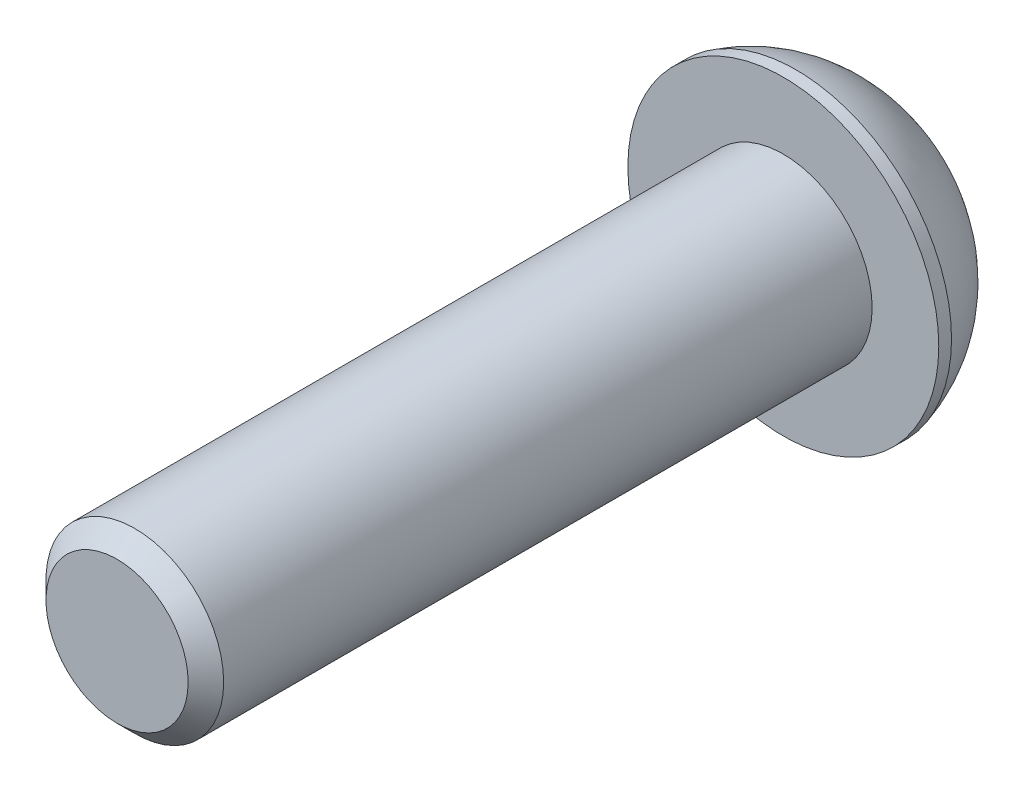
ISO-10303-21;
HEADER;
FILE_DESCRIPTION(('STEP AP214'),'2;1');
FILE_NAME('part.step','',(''),(''),'','','');
FILE_SCHEMA(('AUTOMOTIVE_DESIGN { 1 0 10303 214 1 1 1 1 }'));
ENDSEC;
DATA;
#1=APPLICATION_CONTEXT('core data for automotive mechanical design processes');
#2=APPLICATION_PROTOCOL_DEFINITION('international standard','automotive_design',2000,#1);
#3=PRODUCT_CONTEXT('',#1,'mechanical');
#4=PRODUCT('Part','Part','',(#3));
#5=PRODUCT_RELATED_PRODUCT_CATEGORY('part','',(#4));
#6=PRODUCT_DEFINITION_FORMATION('','',#4);
#7=PRODUCT_DEFINITION_CONTEXT('part definition',#1,'design');
#8=PRODUCT_DEFINITION('design','',#6,#7);
#9=PRODUCT_DEFINITION_SHAPE('','',#8);
#10=(LENGTH_UNIT() NAMED_UNIT(*) SI_UNIT(.MILLI.,.METRE.));
#11=(NAMED_UNIT(*) PLANE_ANGLE_UNIT() SI_UNIT($,.RADIAN.));
#12=(NAMED_UNIT(*) SI_UNIT($,.STERADIAN.) SOLID_ANGLE_UNIT());
#13=UNCERTAINTY_MEASURE_WITH_UNIT(LENGTH_MEASURE(1.E-05),#10,'distance_accuracy_value','');
#14=(GEOMETRIC_REPRESENTATION_CONTEXT(3) GLOBAL_UNCERTAINTY_ASSIGNED_CONTEXT((#13)) GLOBAL_UNIT_ASSIGNED_CONTEXT((#10,
#11,#12)) REPRESENTATION_CONTEXT('',''));
#15=CARTESIAN_POINT('',(0.,0.,0.));
#16=DIRECTION('',(0.,0.,1.));
#17=DIRECTION('',(1.,0.,0.));
#18=AXIS2_PLACEMENT_3D('',#15,#16,#17);
#19=CARTESIAN_POINT('',(0.,0.,-4.4));
#20=DIRECTION('',(0.,0.,1.));
#21=DIRECTION('',(1.,0.,0.));
#22=AXIS2_PLACEMENT_3D('',#19,#20,#21);
#23=PLANE('',#22);
#24=CARTESIAN_POINT('',(0.,0.,-4.4));
#25=DIRECTION('',(0.,0.,-1.));
#26=DIRECTION('',(-1.,0.,0.));
#27=AXIS2_PLACEMENT_3D('',#24,#25,#26);
#28=CIRCLE('',#27,4.06492341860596);
#29=CARTESIAN_POINT('',(-4.06492341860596,0.,-4.4));
#30=VERTEX_POINT('',#29);
#31=EDGE_CURVE('E147',#30,#30,#28,.T.);
#32=ORIENTED_EDGE('',*,*,#31,.T.);
#33=EDGE_LOOP('',(#32));
#34=FACE_BOUND('',#33,.T.);
#35=DIRECTION('',(-0.86602540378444,0.499999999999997,0.));
#36=VECTOR('',#35,1.);
#37=CARTESIAN_POINT('',(0.,2.88675134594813,-4.4));
#38=LINE('',#37,#36);
#39=CARTESIAN_POINT('',(2.5,1.44337567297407,-4.4));
#40=VERTEX_POINT('',#39);
#41=CARTESIAN_POINT('',(0.,2.88675134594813,-4.4));
#42=VERTEX_POINT('',#41);
#43=EDGE_CURVE('E49',#40,#42,#38,.T.);
#44=ORIENTED_EDGE('',*,*,#43,.T.);
#45=DIRECTION('',(-0.866025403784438,-0.500000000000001,0.));
#46=VECTOR('',#45,1.);
#47=CARTESIAN_POINT('',(0.,2.88675134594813,-4.4));
#48=LINE('',#47,#46);
#49=CARTESIAN_POINT('',(-2.5,1.44337567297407,-4.4));
#50=VERTEX_POINT('',#49);
#51=EDGE_CURVE('E120',#42,#50,#48,.T.);
#52=ORIENTED_EDGE('',*,*,#51,.T.);
#53=DIRECTION('',(0.,-1.,0.));
#54=VECTOR('',#53,1.);
#55=CARTESIAN_POINT('',(-2.5,-1.44337567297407,-4.4));
#56=LINE('',#55,#54);
#57=CARTESIAN_POINT('',(-2.5,-1.44337567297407,-4.4));
#58=VERTEX_POINT('',#57);
#59=EDGE_CURVE('E124',#50,#58,#56,.T.);
#60=ORIENTED_EDGE('',*,*,#59,.T.);
#61=DIRECTION('',(0.866025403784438,-0.500000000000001,0.));
#62=VECTOR('',#61,1.);
#63=CARTESIAN_POINT('',(0.,-2.88675134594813,-4.4));
#64=LINE('',#63,#62);
#65=CARTESIAN_POINT('',(0.,-2.88675134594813,-4.4));
#66=VERTEX_POINT('',#65);
#67=EDGE_CURVE('E127',#58,#66,#64,.T.);
#68=ORIENTED_EDGE('',*,*,#67,.T.);
#69=DIRECTION('',(0.86602540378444,0.499999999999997,0.));
#70=VECTOR('',#69,1.);
#71=CARTESIAN_POINT('',(0.,-2.88675134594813,-4.4));
#72=LINE('',#71,#70);
#73=CARTESIAN_POINT('',(2.5,-1.44337567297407,-4.4));
#74=VERTEX_POINT('',#73);
#75=EDGE_CURVE('E110',#66,#74,#72,.T.);
#76=ORIENTED_EDGE('',*,*,#75,.T.);
#77=DIRECTION('',(0.,1.,0.));
#78=VECTOR('',#77,1.);
#79=CARTESIAN_POINT('',(2.5,-1.44337567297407,-4.4));
#80=LINE('',#79,#78);
#81=EDGE_CURVE('E130',#74,#40,#80,.T.);
#82=ORIENTED_EDGE('',*,*,#81,.T.);
#83=EDGE_LOOP('',(#44,#52,#60,#68,#76,#82));
#84=FACE_BOUND('',#83,.T.);
#85=ADVANCED_FACE('F34',(#34,#84),#23,.F.);
#86=CARTESIAN_POINT('',(0.,0.,1.05548398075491));
#87=DIRECTION('',(0.,0.,-1.));
#88=DIRECTION('',(-1.,0.,0.));
#89=AXIS2_PLACEMENT_3D('',#86,#87,#88);
#90=DEGENERATE_TOROIDAL_SURFACE('',#89,0.915198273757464,6.29945028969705,.T.);
#91=ORIENTED_EDGE('',*,*,#31,.F.);
#92=EDGE_LOOP('',(#91));
#93=FACE_BOUND('',#92,.T.);
#94=CARTESIAN_POINT('',(0.,0.,-0.574933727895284));
#95=DIRECTION('',(0.,0.,-1.));
#96=DIRECTION('',(-1.,0.,0.));
#97=AXIS2_PLACEMENT_3D('',#94,#95,#96);
#98=CIRCLE('',#97,7.);
#99=CARTESIAN_POINT('',(-7.,0.,-0.574933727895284));
#100=VERTEX_POINT('',#99);
#101=EDGE_CURVE('E144',#100,#100,#98,.T.);
#102=ORIENTED_EDGE('',*,*,#101,.T.);
#103=EDGE_LOOP('',(#102));
#104=FACE_BOUND('',#103,.T.);
#105=ADVANCED_FACE('F164',(#93,#104),#90,.T.);
#106=CARTESIAN_POINT('',(0.,0.,0.));
#107=DIRECTION('',(0.,0.,-1.));
#108=DIRECTION('',(-1.,0.,0.));
#109=AXIS2_PLACEMENT_3D('',#106,#107,#108);
#110=CYLINDRICAL_SURFACE('',#109,7.);
#111=ORIENTED_EDGE('',*,*,#101,.F.);
#112=EDGE_LOOP('',(#111));
#113=FACE_BOUND('',#112,.T.);
#114=CARTESIAN_POINT('',(0.,0.,0.));
#115=DIRECTION('',(0.,0.,-1.));
#116=DIRECTION('',(-1.,0.,0.));
#117=AXIS2_PLACEMENT_3D('',#114,#115,#116);
#118=CIRCLE('',#117,7.);
#119=CARTESIAN_POINT('',(-7.,0.,0.));
#120=VERTEX_POINT('',#119);
#121=EDGE_CURVE('E141',#120,#120,#118,.T.);
#122=ORIENTED_EDGE('',*,*,#121,.T.);
#123=EDGE_LOOP('',(#122));
#124=FACE_BOUND('',#123,.T.);
#125=ADVANCED_FACE('F169',(#113,#124),#110,.T.);
#126=CARTESIAN_POINT('',(0.,0.,0.));
#127=DIRECTION('',(0.,0.,-1.));
#128=DIRECTION('',(-1.,0.,0.));
#129=AXIS2_PLACEMENT_3D('',#126,#127,#128);
#130=PLANE('',#129);
#131=CARTESIAN_POINT('',(0.,0.,0.));
#132=DIRECTION('',(0.,0.,1.));
#133=DIRECTION('',(1.,0.,0.));
#134=AXIS2_PLACEMENT_3D('',#131,#132,#133);
#135=CIRCLE('',#134,4.);
#136=CARTESIAN_POINT('',(4.,0.,0.));
#137=VERTEX_POINT('',#136);
#138=EDGE_CURVE('E121',#137,#137,#135,.T.);
#139=ORIENTED_EDGE('',*,*,#138,.F.);
#140=EDGE_LOOP('',(#139));
#141=FACE_BOUND('',#140,.T.);
#142=ORIENTED_EDGE('',*,*,#121,.F.);
#143=EDGE_LOOP('',(#142));
#144=FACE_BOUND('',#143,.T.);
#145=ADVANCED_FACE('F176',(#141,#144),#130,.F.);
#146=CARTESIAN_POINT('',(0.,2.88675134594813,-1.8));
#147=DIRECTION('',(-0.499999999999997,-0.86602540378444,0.));
#148=DIRECTION('',(0.86602540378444,-0.499999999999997,0.));
#149=AXIS2_PLACEMENT_3D('',#146,#147,#148);
#150=PLANE('',#149);
#151=ORIENTED_EDGE('',*,*,#43,.F.);
#152=DIRECTION('',(0.,0.,-1.));
#153=VECTOR('',#152,1.);
#154=CARTESIAN_POINT('',(2.5,1.44337567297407,-1.8));
#155=LINE('',#154,#153);
#156=CARTESIAN_POINT('',(2.5,1.44337567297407,-1.8));
#157=VERTEX_POINT('',#156);
#158=EDGE_CURVE('E115',#157,#40,#155,.T.);
#159=ORIENTED_EDGE('',*,*,#158,.F.);
#160=DIRECTION('',(-0.86602540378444,0.499999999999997,0.));
#161=VECTOR('',#160,1.);
#162=CARTESIAN_POINT('',(0.,2.88675134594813,-1.8));
#163=LINE('',#162,#161);
#164=CARTESIAN_POINT('',(0.,2.88675134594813,-1.8));
#165=VERTEX_POINT('',#164);
#166=EDGE_CURVE('E133',#157,#165,#163,.T.);
#167=ORIENTED_EDGE('',*,*,#166,.T.);
#168=DIRECTION('',(0.,0.,-1.));
#169=VECTOR('',#168,1.);
#170=CARTESIAN_POINT('',(0.,2.88675134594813,-1.8));
#171=LINE('',#170,#169);
#172=EDGE_CURVE('E139',#165,#42,#171,.T.);
#173=ORIENTED_EDGE('',*,*,#172,.T.);
#174=EDGE_LOOP('',(#151,#159,#167,#173));
#175=FACE_BOUND('',#174,.T.);
#176=ADVANCED_FACE('F180',(#175),#150,.T.);
#177=CARTESIAN_POINT('',(0.,2.88675134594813,-1.8));
#178=DIRECTION('',(0.500000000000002,-0.866025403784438,0.));
#179=DIRECTION('',(0.866025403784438,0.500000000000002,0.));
#180=AXIS2_PLACEMENT_3D('',#177,#178,#179);
#181=PLANE('',#180);
#182=ORIENTED_EDGE('',*,*,#51,.F.);
#183=ORIENTED_EDGE('',*,*,#172,.F.);
#184=DIRECTION('',(-0.866025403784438,-0.500000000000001,0.));
#185=VECTOR('',#184,1.);
#186=CARTESIAN_POINT('',(0.,2.88675134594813,-1.8));
#187=LINE('',#186,#185);
#188=CARTESIAN_POINT('',(-2.5,1.44337567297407,-1.8));
#189=VERTEX_POINT('',#188);
#190=EDGE_CURVE('E88',#165,#189,#187,.T.);
#191=ORIENTED_EDGE('',*,*,#190,.T.);
#192=DIRECTION('',(0.,0.,-1.));
#193=VECTOR('',#192,1.);
#194=CARTESIAN_POINT('',(-2.5,1.44337567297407,-1.8));
#195=LINE('',#194,#193);
#196=EDGE_CURVE('E137',#189,#50,#195,.T.);
#197=ORIENTED_EDGE('',*,*,#196,.T.);
#198=EDGE_LOOP('',(#182,#183,#191,#197));
#199=FACE_BOUND('',#198,.T.);
#200=ADVANCED_FACE('F184',(#199),#181,.T.);
#201=CARTESIAN_POINT('',(-2.5,-1.44337567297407,-1.8));
#202=DIRECTION('',(1.,0.,0.));
#203=DIRECTION('',(0.,0.,-1.));
#204=AXIS2_PLACEMENT_3D('',#201,#202,#203);
#205=PLANE('',#204);
#206=ORIENTED_EDGE('',*,*,#59,.F.);
#207=ORIENTED_EDGE('',*,*,#196,.F.);
#208=DIRECTION('',(0.,-1.,0.));
#209=VECTOR('',#208,1.);
#210=CARTESIAN_POINT('',(-2.5,-1.44337567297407,-1.8));
#211=LINE('',#210,#209);
#212=CARTESIAN_POINT('',(-2.5,-1.44337567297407,-1.8));
#213=VERTEX_POINT('',#212);
#214=EDGE_CURVE('E106',#189,#213,#211,.T.);
#215=ORIENTED_EDGE('',*,*,#214,.T.);
#216=DIRECTION('',(0.,0.,-1.));
#217=VECTOR('',#216,1.);
#218=CARTESIAN_POINT('',(-2.5,-1.44337567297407,-1.8));
#219=LINE('',#218,#217);
#220=EDGE_CURVE('E103',#213,#58,#219,.T.);
#221=ORIENTED_EDGE('',*,*,#220,.T.);
#222=EDGE_LOOP('',(#206,#207,#215,#221));
#223=FACE_BOUND('',#222,.T.);
#224=ADVANCED_FACE('F187',(#223),#205,.T.);
#225=CARTESIAN_POINT('',(0.,-2.88675134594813,-1.8));
#226=DIRECTION('',(0.500000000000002,0.866025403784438,0.));
#227=DIRECTION('',(-0.866025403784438,0.500000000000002,0.));
#228=AXIS2_PLACEMENT_3D('',#225,#226,#227);
#229=PLANE('',#228);
#230=ORIENTED_EDGE('',*,*,#67,.F.);
#231=ORIENTED_EDGE('',*,*,#220,.F.);
#232=DIRECTION('',(0.866025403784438,-0.500000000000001,0.));
#233=VECTOR('',#232,1.);
#234=CARTESIAN_POINT('',(0.,-2.88675134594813,-1.8));
#235=LINE('',#234,#233);
#236=CARTESIAN_POINT('',(0.,-2.88675134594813,-1.8));
#237=VERTEX_POINT('',#236);
#238=EDGE_CURVE('E98',#213,#237,#235,.T.);
#239=ORIENTED_EDGE('',*,*,#238,.T.);
#240=DIRECTION('',(0.,0.,-1.));
#241=VECTOR('',#240,1.);
#242=CARTESIAN_POINT('',(0.,-2.88675134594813,-1.8));
#243=LINE('',#242,#241);
#244=EDGE_CURVE('E102',#237,#66,#243,.T.);
#245=ORIENTED_EDGE('',*,*,#244,.T.);
#246=EDGE_LOOP('',(#230,#231,#239,#245));
#247=FACE_BOUND('',#246,.T.);
#248=ADVANCED_FACE('F101',(#247),#229,.T.);
#249=CARTESIAN_POINT('',(0.,-2.88675134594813,-1.8));
#250=DIRECTION('',(-0.499999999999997,0.86602540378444,0.));
#251=DIRECTION('',(-0.86602540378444,-0.499999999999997,0.));
#252=AXIS2_PLACEMENT_3D('',#249,#250,#251);
#253=PLANE('',#252);
#254=ORIENTED_EDGE('',*,*,#75,.F.);
#255=ORIENTED_EDGE('',*,*,#244,.F.);
#256=DIRECTION('',(0.86602540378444,0.499999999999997,0.));
#257=VECTOR('',#256,1.);
#258=CARTESIAN_POINT('',(0.,-2.88675134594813,-1.8));
#259=LINE('',#258,#257);
#260=CARTESIAN_POINT('',(2.5,-1.44337567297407,-1.8));
#261=VERTEX_POINT('',#260);
#262=EDGE_CURVE('E105',#237,#261,#259,.T.);
#263=ORIENTED_EDGE('',*,*,#262,.T.);
#264=DIRECTION('',(0.,0.,-1.));
#265=VECTOR('',#264,1.);
#266=CARTESIAN_POINT('',(2.5,-1.44337567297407,-1.8));
#267=LINE('',#266,#265);
#268=EDGE_CURVE('E79',#261,#74,#267,.T.);
#269=ORIENTED_EDGE('',*,*,#268,.T.);
#270=EDGE_LOOP('',(#254,#255,#263,#269));
#271=FACE_BOUND('',#270,.T.);
#272=ADVANCED_FACE('F108',(#271),#253,.T.);
#273=CARTESIAN_POINT('',(2.5,-1.44337567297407,-1.8));
#274=DIRECTION('',(-1.,0.,0.));
#275=DIRECTION('',(0.,0.,1.));
#276=AXIS2_PLACEMENT_3D('',#273,#274,#275);
#277=PLANE('',#276);
#278=ORIENTED_EDGE('',*,*,#81,.F.);
#279=ORIENTED_EDGE('',*,*,#268,.F.);
#280=DIRECTION('',(0.,1.,0.));
#281=VECTOR('',#280,1.);
#282=CARTESIAN_POINT('',(2.5,-1.44337567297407,-1.8));
#283=LINE('',#282,#281);
#284=EDGE_CURVE('E57',#261,#157,#283,.T.);
#285=ORIENTED_EDGE('',*,*,#284,.T.);
#286=ORIENTED_EDGE('',*,*,#158,.T.);
#287=EDGE_LOOP('',(#278,#279,#285,#286));
#288=FACE_BOUND('',#287,.T.);
#289=ADVANCED_FACE('F196',(#288),#277,.T.);
#290=CARTESIAN_POINT('',(2.5,1.44337567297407,-1.8));
#291=DIRECTION('',(0.,0.,1.));
#292=DIRECTION('',(1.,0.,0.));
#293=AXIS2_PLACEMENT_3D('',#290,#291,#292);
#294=PLANE('',#293);
#295=ORIENTED_EDGE('',*,*,#166,.F.);
#296=ORIENTED_EDGE('',*,*,#284,.F.);
#297=ORIENTED_EDGE('',*,*,#262,.F.);
#298=ORIENTED_EDGE('',*,*,#238,.F.);
#299=ORIENTED_EDGE('',*,*,#214,.F.);
#300=ORIENTED_EDGE('',*,*,#190,.F.);
#301=EDGE_LOOP('',(#295,#296,#297,#298,#299,#300));
#302=FACE_BOUND('',#301,.T.);
#303=ADVANCED_FACE('F113',(#302),#294,.F.);
#304=CARTESIAN_POINT('',(0.,0.,30.));
#305=DIRECTION('',(0.,0.,1.));
#306=DIRECTION('',(1.,0.,0.));
#307=AXIS2_PLACEMENT_3D('',#304,#305,#306);
#308=PLANE('',#307);
#309=CARTESIAN_POINT('',(0.,0.,30.));
#310=DIRECTION('',(0.,0.,1.));
#311=DIRECTION('',(1.,0.,0.));
#312=AXIS2_PLACEMENT_3D('',#309,#310,#311);
#313=CIRCLE('',#312,3.2);
#314=CARTESIAN_POINT('',(3.2,0.,30.));
#315=VERTEX_POINT('',#314);
#316=EDGE_CURVE('E42',#315,#315,#313,.T.);
#317=ORIENTED_EDGE('',*,*,#316,.T.);
#318=EDGE_LOOP('',(#317));
#319=FACE_BOUND('',#318,.T.);
#320=ADVANCED_FACE('F152',(#319),#308,.T.);
#321=CARTESIAN_POINT('',(0.,0.,0.));
#322=DIRECTION('',(0.,0.,1.));
#323=DIRECTION('',(1.,0.,0.));
#324=AXIS2_PLACEMENT_3D('',#321,#322,#323);
#325=CYLINDRICAL_SURFACE('',#324,4.);
#326=CARTESIAN_POINT('',(0.,0.,29.2));
#327=DIRECTION('',(0.,0.,1.));
#328=DIRECTION('',(1.,0.,0.));
#329=AXIS2_PLACEMENT_3D('',#326,#327,#328);
#330=CIRCLE('',#329,4.);
#331=CARTESIAN_POINT('',(4.,0.,29.2));
#332=VERTEX_POINT('',#331);
#333=EDGE_CURVE('E11',#332,#332,#330,.F.);
#334=ORIENTED_EDGE('',*,*,#333,.T.);
#335=EDGE_LOOP('',(#334));
#336=FACE_BOUND('',#335,.T.);
#337=ORIENTED_EDGE('',*,*,#138,.T.);
#338=EDGE_LOOP('',(#337));
#339=FACE_BOUND('',#338,.T.);
#340=ADVANCED_FACE('F155',(#336,#339),#325,.T.);
#341=CARTESIAN_POINT('',(0.,0.,30.));
#342=DIRECTION('',(0.,0.,-1.));
#343=DIRECTION('',(-1.,0.,0.));
#344=AXIS2_PLACEMENT_3D('',#341,#342,#343);
#345=CONICAL_SURFACE('',#344,3.2,0.785398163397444);
#346=ORIENTED_EDGE('',*,*,#333,.F.);
#347=EDGE_LOOP('',(#346));
#348=FACE_BOUND('',#347,.T.);
#349=ORIENTED_EDGE('',*,*,#316,.F.);
#350=EDGE_LOOP('',(#349));
#351=FACE_BOUND('',#350,.T.);
#352=ADVANCED_FACE('F36',(#348,#351),#345,.T.);
#353=CLOSED_SHELL('',(#85,#105,#125,#145,#176,#200,#224,#248,#272,#289,#303,#320,#340,#352));
#354=MANIFOLD_SOLID_BREP('B2',#353);
#355=ADVANCED_BREP_SHAPE_REPRESENTATION('',(#18,#354),#14);
#356=SHAPE_DEFINITION_REPRESENTATION(#9,#355);
ENDSEC;
END-ISO-10303-21;
